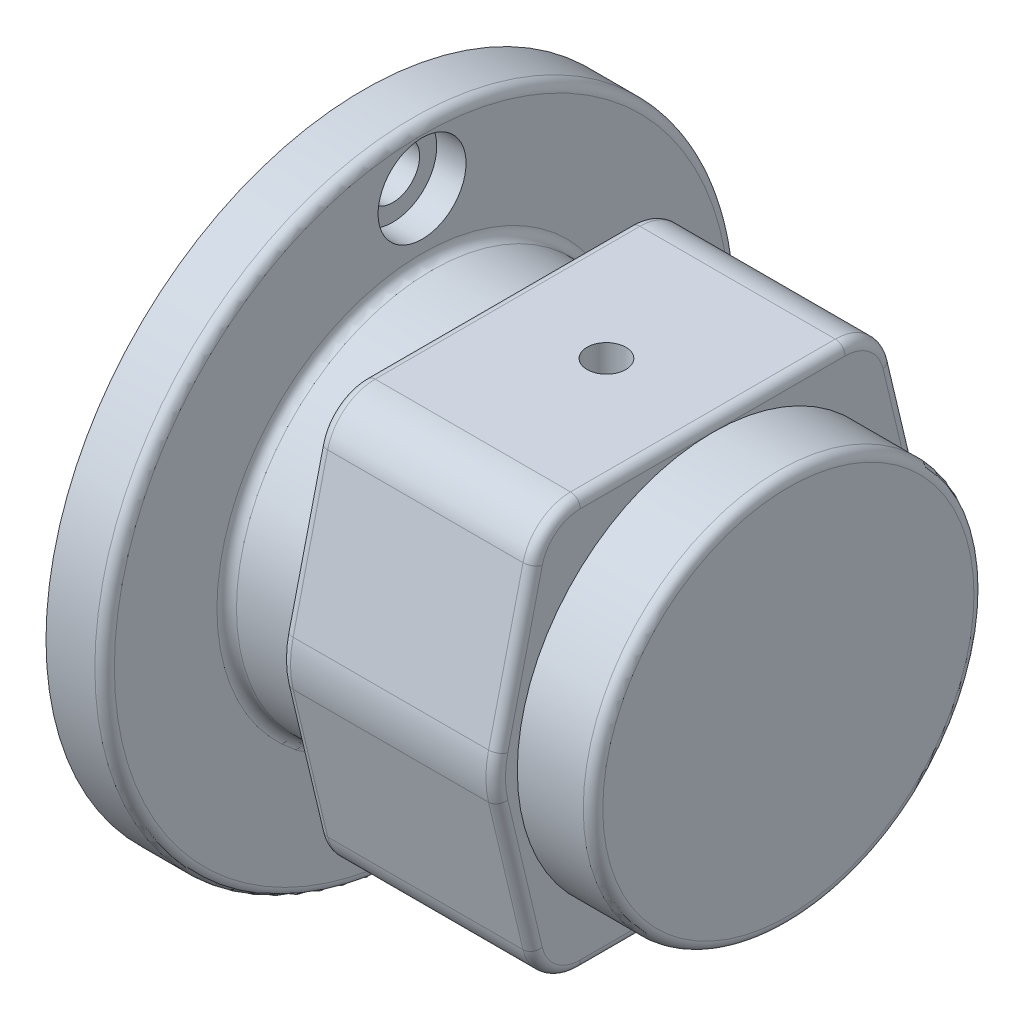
from build123d import *

# Parameters (mm, degrees)
EXTRUSION1_DEPTH                                   = 22
EXTRUSION1_DEPTH_BACK                              = 22
CONG_1_R                                           = 2
CHAMBRAGE_POUR_VIS_T_TE_RONDE_BOMB_E_M_D           = 11
CHAMBRAGE_POUR_VIS_T_TE_RONDE_BOMB_E_M_CBORE_D     = 18
CHAMBRAGE_POUR_VIS_T_TE_RONDE_BOMB_E_M_CBORE_DEPTH = 6
R_P_TITION_CIRCULAIRE1_COUNT                       = 2
TROU_TARAUD_3_8_161_D                              = 7.9375
CHANFREIN1_SIZE                                    = 1


with BuildPart() as part:
    # Esquisse1 → R_volution1 (revolve)
    with BuildSketch(Plane.XY, mode=Mode.PRIVATE) as r_volution1_sk:
        Polygon((0, 0), (0, 32.5), (-5.999999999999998, 32.5), (-6, 39.999999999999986), (0, 39.999999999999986), (0, 65), (12, 65), (12.000000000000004, 39.99999999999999), (87, 40), (87, 0), align=None)
    revolve(r_volution1_sk.sketch.rotate(Axis((0, 0, 0), (1, 0, 0)), 90), axis=Axis((0, 0, 0), (1, 0, 0)))

    # Esquisse2 → Extrusion1 (add, two sides: drawn at the far end of the back side and taken through both)
    with BuildSketch(Plane.ZY.offset(-49.5).offset(-EXTRUSION1_DEPTH_BACK)):
        with BuildLine():
            Line((-27.1014127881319, 42), (27.1014127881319, 42))
            ThreePointArc((27.1014127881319, 42), (33.299716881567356, 39.847357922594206), (36.82947493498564, 34.31620527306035))
            Line((36.82947493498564, 34.31620527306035), (43.897045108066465, 4.632410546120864))
            ThreePointArc((43.897045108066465, 4.632410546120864), (44.440920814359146, 0), (43.897045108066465, -4.632410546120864))
            Line((43.897045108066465, -4.632410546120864), (36.82947493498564, -34.31620527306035))
            ThreePointArc((36.82947493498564, -34.31620527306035), (33.299716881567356, -39.847357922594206), (27.1014127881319, -42))
            Line((27.1014127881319, -42), (-27.1014127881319, -42))
            ThreePointArc((-27.1014127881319, -42), (-33.299716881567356, -39.847357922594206), (-36.82947493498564, -34.31620527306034))
            Line((-36.82947493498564, -34.31620527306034), (-43.89704510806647, -4.632410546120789))
            ThreePointArc((-43.89704510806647, -4.632410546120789), (-44.44092081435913, -2.45e-15), (-43.89704510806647, 4.632410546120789))
            Line((-43.89704510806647, 4.632410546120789), (-36.82947493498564, 34.31620527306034))
            ThreePointArc((-36.82947493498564, 34.31620527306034), (-33.299716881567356, 39.847357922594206), (-27.1014127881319, 42))
        make_face()
    extrude(amount=EXTRUSION1_DEPTH + EXTRUSION1_DEPTH_BACK)

    # Cong_1
    cong_1_edges = [part.edges().sort_by_distance(p)[0] for p in [
        (27.5, 39.847357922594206, -33.29971688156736),
        (27.5, 19.474307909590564, -40.36326002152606),
        (27.5, -6.7e-16, -44.44092081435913),
        (27.5, -19.474307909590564, -40.36326002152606),
        (27.5, -39.847357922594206, -33.299716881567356),
        (27.5, -42, 0),
        (27.5, -39.847357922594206, 33.299716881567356),
        (27.5, -19.474307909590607, 40.36326002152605),
        (27.5, 8.9e-16, 44.440920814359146),
        (27.5, 19.474307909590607, 40.36326002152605),
        (27.5, 39.847357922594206, 33.299716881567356),
        (27.5, 42, 0),
        (71.5, 39.847357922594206, -33.29971688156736),
        (71.5, 19.474307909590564, -40.36326002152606),
        (71.5, -6.7e-16, -44.44092081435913),
        (71.5, -19.474307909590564, -40.36326002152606),
        (71.5, -39.847357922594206, -33.299716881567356),
        (71.5, -42, 0),
        (71.5, -39.847357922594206, 33.299716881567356),
        (71.5, -19.474307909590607, 40.36326002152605),
        (71.5, 8.9e-16, 44.440920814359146),
        (71.5, 19.474307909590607, 40.36326002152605),
        (71.5, 39.847357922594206, 33.299716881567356),
        (71.5, 42, 0),
        (87, -9.34e-15, -40),
        (12.000000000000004, -9.34e-15, -39.99999999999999),
        (12, -1.518e-14, -65),
    ]]
    fillet(cong_1_edges, radius=CONG_1_R)

    # Chambrage pour vis _ t_te ronde bomb_e M (through all)
    with Locations(Plane(origin=(12.000000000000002, 0, 0), x_dir=(0, 0, -1), z_dir=(1, 0, 0))):
        with Locations((0, 53.5)):
            chambrage_pour_vis_t_te_ronde_bomb_e_m = CounterBoreHole(CHAMBRAGE_POUR_VIS_T_TE_RONDE_BOMB_E_M_D / 2, CHAMBRAGE_POUR_VIS_T_TE_RONDE_BOMB_E_M_CBORE_D / 2, CHAMBRAGE_POUR_VIS_T_TE_RONDE_BOMB_E_M_CBORE_DEPTH)

    # R_p_tition circulaire1: Chambrage pour vis _ t_te ronde bomb_e M ×2 about axis
    r_p_tition_circulaire1_axis = Axis((0, 0, 0), (1, 0, 0))
    for i in range(1, R_P_TITION_CIRCULAIRE1_COUNT):
        add(chambrage_pour_vis_t_te_ronde_bomb_e_m.rotate(r_p_tition_circulaire1_axis, i * 360 / R_P_TITION_CIRCULAIRE1_COUNT), mode=Mode.SUBTRACT)

    # Trou taraud_ 3_8-161 (through all)
    with Locations(Plane(origin=(49.5, 42, -0.246627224), x_dir=(0, 0, 1), z_dir=(0, 1, 0))):
        with Locations((0, 0)):
            Hole(TROU_TARAUD_3_8_161_D / 2)

    # Chanfrein1
    chanfrein1_edges = [part.edges().sort_by_distance(p)[0] for p in [
        (-6, -9.34e-15, -39.999999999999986),
    ]]
    chamfer(chanfrein1_edges, length=CHANFREIN1_SIZE)


solid = part.part
